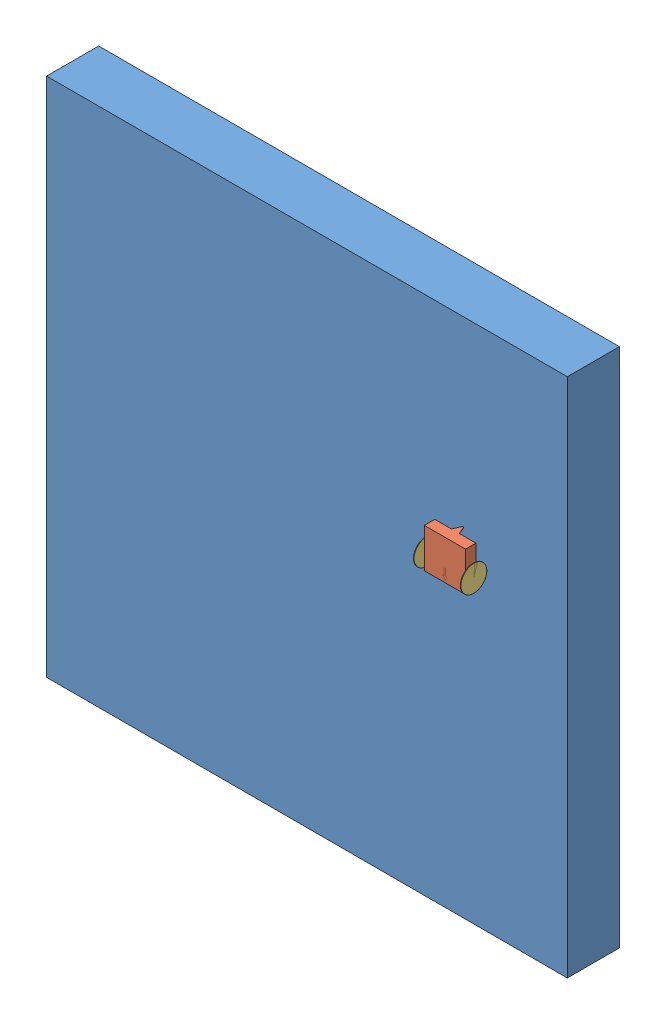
SolidWorks assembly PaperBotSimulation.SLDASM, configuration Default (file format 13000). Lengths in mm.
Overall size (1000 1000 154.04).
5 component instances, 3 part files, 6 mates.
Components (placement in the parent):
- Floor-1: Floor.SLDPRT [Default] at origin size (1000 1000 100)
- PaperBot-1: PaperBot.SLDASM [Default] at (839.5 650.5 15) x (-1 0 0) z (0 1 0) size (91 58.08 79.54) (flexible)
  - PaperBase-1: PaperBase.SLDPRT [Default] at origin size (89 35 75.5)
  - PaperWheels-1: PaperWheels.SLDPRT [Default] at (85 10 -50.5) x (0 -0.984112 -0.177548) z (0 0.177548 -0.984112) size (50 1 50)
  - PaperWheels-2: PaperWheels.SLDPRT [Default] at (-6 10 -50.5) x (0 0.984112 0.177548) z (0 0.177548 -0.984112) size (50 1 50)
Mates (geometry in assembly coordinates):
- Tangent1: tangent: plane of Floor-1 through (0 0 0) normal (0 0 1); circle of PaperBot-1/PaperWheels-1
- Tangent2: tangent: plane of Floor-1 through (0 0 0) normal (0 0 1); circle of PaperBot-1/PaperWheels-2
- Coincident3: coincident: plane of Floor-1 through (0 0 0) normal (0 0 1); plane of PaperBot-1/PaperBase-1
- Distance1: distance = 800 mm: point of PaperBot-1; plane of Floor-1 through (0 1000 -100) normal (-1 0 0)
- Distance2: distance = 600 mm: point of PaperBot-1; plane of Floor-1 through (0 0 -100) normal (0 -1 0)
- Angle1: planar angle = 3.141593 rad aligned: plane of PaperBot-1/PaperBase-1; plane of Floor-1 through (0 1000 -100) normal (-1 0 0)
